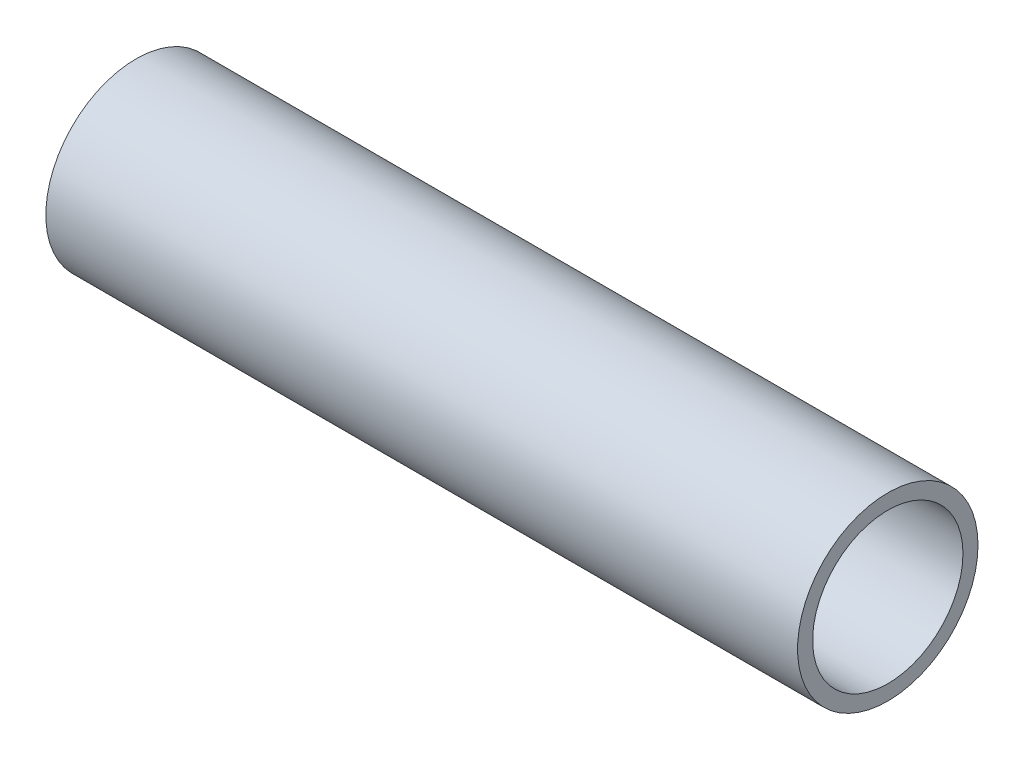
ISO-10303-21;
HEADER;
FILE_DESCRIPTION(('STEP AP214'),'2;1');
FILE_NAME('part.step','',(''),(''),'','','');
FILE_SCHEMA(('AUTOMOTIVE_DESIGN { 1 0 10303 214 1 1 1 1 }'));
ENDSEC;
DATA;
#1=APPLICATION_CONTEXT('core data for automotive mechanical design processes');
#2=APPLICATION_PROTOCOL_DEFINITION('international standard','automotive_design',2000,#1);
#3=PRODUCT_CONTEXT('',#1,'mechanical');
#4=PRODUCT('Part','Part','',(#3));
#5=PRODUCT_RELATED_PRODUCT_CATEGORY('part','',(#4));
#6=PRODUCT_DEFINITION_FORMATION('','',#4);
#7=PRODUCT_DEFINITION_CONTEXT('part definition',#1,'design');
#8=PRODUCT_DEFINITION('design','',#6,#7);
#9=PRODUCT_DEFINITION_SHAPE('','',#8);
#10=(LENGTH_UNIT() NAMED_UNIT(*) SI_UNIT(.MILLI.,.METRE.));
#11=(NAMED_UNIT(*) PLANE_ANGLE_UNIT() SI_UNIT($,.RADIAN.));
#12=(NAMED_UNIT(*) SI_UNIT($,.STERADIAN.) SOLID_ANGLE_UNIT());
#13=UNCERTAINTY_MEASURE_WITH_UNIT(LENGTH_MEASURE(1.E-05),#10,'distance_accuracy_value','');
#14=(GEOMETRIC_REPRESENTATION_CONTEXT(3) GLOBAL_UNCERTAINTY_ASSIGNED_CONTEXT((#13)) GLOBAL_UNIT_ASSIGNED_CONTEXT((#10,
#11,#12)) REPRESENTATION_CONTEXT('',''));
#15=CARTESIAN_POINT('',(0.,0.,0.));
#16=DIRECTION('',(0.,0.,1.));
#17=DIRECTION('',(1.,0.,0.));
#18=AXIS2_PLACEMENT_3D('',#15,#16,#17);
#19=CARTESIAN_POINT('',(25.,0.,0.));
#20=DIRECTION('',(1.,0.,0.));
#21=DIRECTION('',(0.,0.,-1.));
#22=AXIS2_PLACEMENT_3D('',#19,#20,#21);
#23=PLANE('',#22);
#24=CARTESIAN_POINT('',(25.,0.,0.));
#25=DIRECTION('',(1.,0.,0.));
#26=DIRECTION('',(0.,0.,-1.));
#27=AXIS2_PLACEMENT_3D('',#24,#25,#26);
#28=CIRCLE('',#27,6.);
#29=CARTESIAN_POINT('',(25.,0.,-6.));
#30=VERTEX_POINT('',#29);
#31=EDGE_CURVE('E10',#30,#30,#28,.T.);
#32=ORIENTED_EDGE('',*,*,#31,.T.);
#33=EDGE_LOOP('',(#32));
#34=FACE_BOUND('',#33,.T.);
#35=CARTESIAN_POINT('',(25.,0.,0.));
#36=DIRECTION('',(1.,0.,0.));
#37=DIRECTION('',(0.,0.,-1.));
#38=AXIS2_PLACEMENT_3D('',#35,#36,#37);
#39=CIRCLE('',#38,5.);
#40=CARTESIAN_POINT('',(25.,0.,-5.));
#41=VERTEX_POINT('',#40);
#42=EDGE_CURVE('E41',#41,#41,#39,.T.);
#43=ORIENTED_EDGE('',*,*,#42,.F.);
#44=EDGE_LOOP('',(#43));
#45=FACE_BOUND('',#44,.T.);
#46=ADVANCED_FACE('F30',(#34,#45),#23,.T.);
#47=CARTESIAN_POINT('',(-25.,0.,0.));
#48=DIRECTION('',(1.,0.,0.));
#49=DIRECTION('',(0.,0.,-1.));
#50=AXIS2_PLACEMENT_3D('',#47,#48,#49);
#51=PLANE('',#50);
#52=CARTESIAN_POINT('',(-25.,0.,0.));
#53=DIRECTION('',(1.,0.,0.));
#54=DIRECTION('',(0.,0.,-1.));
#55=AXIS2_PLACEMENT_3D('',#52,#53,#54);
#56=CIRCLE('',#55,6.);
#57=CARTESIAN_POINT('',(-25.,0.,-6.));
#58=VERTEX_POINT('',#57);
#59=EDGE_CURVE('E34',#58,#58,#56,.T.);
#60=ORIENTED_EDGE('',*,*,#59,.F.);
#61=EDGE_LOOP('',(#60));
#62=FACE_BOUND('',#61,.T.);
#63=CARTESIAN_POINT('',(-25.,0.,0.));
#64=DIRECTION('',(1.,0.,0.));
#65=DIRECTION('',(0.,0.,-1.));
#66=AXIS2_PLACEMENT_3D('',#63,#64,#65);
#67=CIRCLE('',#66,5.);
#68=CARTESIAN_POINT('',(-25.,0.,-5.));
#69=VERTEX_POINT('',#68);
#70=EDGE_CURVE('E43',#69,#69,#67,.T.);
#71=ORIENTED_EDGE('',*,*,#70,.T.);
#72=EDGE_LOOP('',(#71));
#73=FACE_BOUND('',#72,.T.);
#74=ADVANCED_FACE('F53',(#62,#73),#51,.F.);
#75=CARTESIAN_POINT('',(25.,0.,0.));
#76=DIRECTION('',(-1.,0.,0.));
#77=DIRECTION('',(0.,0.,1.));
#78=AXIS2_PLACEMENT_3D('',#75,#76,#77);
#79=CYLINDRICAL_SURFACE('',#78,6.);
#80=ORIENTED_EDGE('',*,*,#31,.F.);
#81=EDGE_LOOP('',(#80));
#82=FACE_BOUND('',#81,.T.);
#83=ORIENTED_EDGE('',*,*,#59,.T.);
#84=EDGE_LOOP('',(#83));
#85=FACE_BOUND('',#84,.T.);
#86=ADVANCED_FACE('F32',(#82,#85),#79,.T.);
#87=CARTESIAN_POINT('',(25.,0.,0.));
#88=DIRECTION('',(-1.,0.,0.));
#89=DIRECTION('',(0.,0.,1.));
#90=AXIS2_PLACEMENT_3D('',#87,#88,#89);
#91=CYLINDRICAL_SURFACE('',#90,5.);
#92=ORIENTED_EDGE('',*,*,#42,.T.);
#93=EDGE_LOOP('',(#92));
#94=FACE_BOUND('',#93,.T.);
#95=ORIENTED_EDGE('',*,*,#70,.F.);
#96=EDGE_LOOP('',(#95));
#97=FACE_BOUND('',#96,.T.);
#98=ADVANCED_FACE('F49',(#94,#97),#91,.F.);
#99=CLOSED_SHELL('',(#46,#74,#86,#98));
#100=MANIFOLD_SOLID_BREP('B2',#99);
#101=ADVANCED_BREP_SHAPE_REPRESENTATION('',(#18,#100),#14);
#102=SHAPE_DEFINITION_REPRESENTATION(#9,#101);
ENDSEC;
END-ISO-10303-21;
